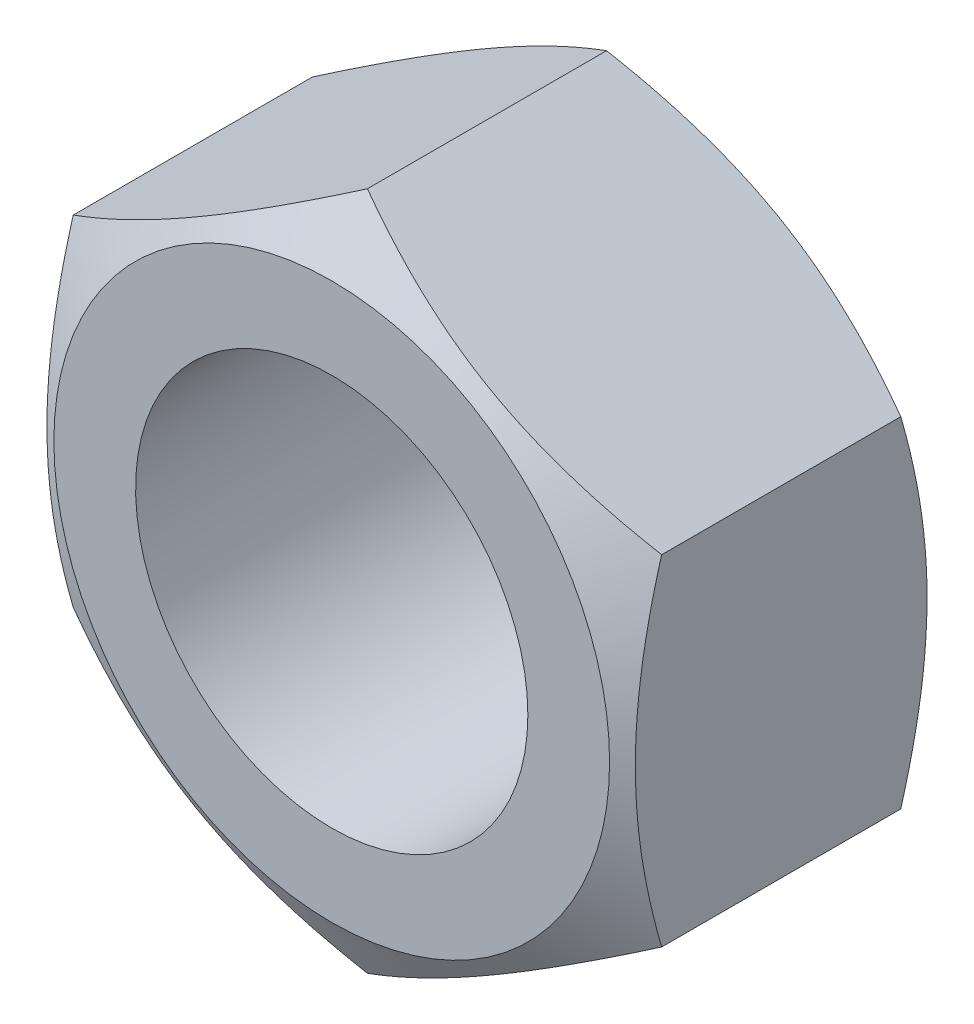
ISO-10303-21;
HEADER;
FILE_DESCRIPTION(('STEP AP214'),'2;1');
FILE_NAME('part.step','',(''),(''),'','','');
FILE_SCHEMA(('AUTOMOTIVE_DESIGN { 1 0 10303 214 1 1 1 1 }'));
ENDSEC;
DATA;
#1=APPLICATION_CONTEXT('core data for automotive mechanical design processes');
#2=APPLICATION_PROTOCOL_DEFINITION('international standard','automotive_design',2000,#1);
#3=PRODUCT_CONTEXT('',#1,'mechanical');
#4=PRODUCT('Part','Part','',(#3));
#5=PRODUCT_RELATED_PRODUCT_CATEGORY('part','',(#4));
#6=PRODUCT_DEFINITION_FORMATION('','',#4);
#7=PRODUCT_DEFINITION_CONTEXT('part definition',#1,'design');
#8=PRODUCT_DEFINITION('design','',#6,#7);
#9=PRODUCT_DEFINITION_SHAPE('','',#8);
#10=(LENGTH_UNIT() NAMED_UNIT(*) SI_UNIT(.MILLI.,.METRE.));
#11=(NAMED_UNIT(*) PLANE_ANGLE_UNIT() SI_UNIT($,.RADIAN.));
#12=(NAMED_UNIT(*) SI_UNIT($,.STERADIAN.) SOLID_ANGLE_UNIT());
#13=UNCERTAINTY_MEASURE_WITH_UNIT(LENGTH_MEASURE(1.E-05),#10,'distance_accuracy_value','');
#14=(GEOMETRIC_REPRESENTATION_CONTEXT(3) GLOBAL_UNCERTAINTY_ASSIGNED_CONTEXT((#13)) GLOBAL_UNIT_ASSIGNED_CONTEXT((#10,
#11,#12)) REPRESENTATION_CONTEXT('',''));
#15=CARTESIAN_POINT('',(0.,0.,0.));
#16=DIRECTION('',(0.,0.,1.));
#17=DIRECTION('',(1.,0.,0.));
#18=AXIS2_PLACEMENT_3D('',#15,#16,#17);
#19=CARTESIAN_POINT('',(-18.,-10.3923048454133,21.));
#20=DIRECTION('',(-1.,0.,0.));
#21=DIRECTION('',(0.,0.,1.));
#22=AXIS2_PLACEMENT_3D('',#19,#20,#21);
#23=PLANE('',#22);
#24=DIRECTION('',(0.,0.,-1.));
#25=VECTOR('',#24,1.);
#26=CARTESIAN_POINT('',(-18.,-10.3923048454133,21.));
#27=LINE('',#26,#25);
#28=CARTESIAN_POINT('',(-18.,-10.3923048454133,16.8149545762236));
#29=VERTEX_POINT('',#28);
#30=CARTESIAN_POINT('',(-18.,-10.3923048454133,2.18504542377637));
#31=VERTEX_POINT('',#30);
#32=EDGE_CURVE('E9',#29,#31,#27,.T.);
#33=ORIENTED_EDGE('',*,*,#32,.F.);
#34=CARTESIAN_POINT('',(-18.,-27.678158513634,9.75294647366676));
#35=CARTESIAN_POINT('',(-18.,-27.2860533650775,9.94272235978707));
#36=CARTESIAN_POINT('',(-18.,-26.8934816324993,10.1315337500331));
#37=CARTESIAN_POINT('',(-18.,-26.1073075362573,10.5070086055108));
#38=CARTESIAN_POINT('',(-18.,-25.7137051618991,10.693672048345));
#39=CARTESIAN_POINT('',(-18.,-24.5310977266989,11.2501628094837));
#40=CARTESIAN_POINT('',(-18.,-23.7404120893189,11.6164324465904));
#41=CARTESIAN_POINT('',(-18.,-22.1492517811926,12.3392469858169));
#42=CARTESIAN_POINT('',(-18.,-21.3487470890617,12.6957259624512));
#43=CARTESIAN_POINT('',(-18.,-19.7412878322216,13.3937806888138));
#44=CARTESIAN_POINT('',(-18.,-18.9343335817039,13.7353571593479));
#45=CARTESIAN_POINT('',(-18.,-17.2876078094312,14.4099305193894));
#46=CARTESIAN_POINT('',(-18.,-16.4475927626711,14.7423360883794));
#47=CARTESIAN_POINT('',(-18.,-14.7576419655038,15.3814120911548));
#48=CARTESIAN_POINT('',(-18.,-13.9077051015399,15.6880796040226));
#49=CARTESIAN_POINT('',(-18.,-12.1982556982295,16.2674507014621));
#50=CARTESIAN_POINT('',(-18.,-11.3387673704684,16.5402251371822));
#51=CARTESIAN_POINT('',(-18.,-9.60738310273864,17.042915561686));
#52=CARTESIAN_POINT('',(-18.,-8.73549124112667,17.2728453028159));
#53=CARTESIAN_POINT('',(-18.,-7.42060770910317,17.5765484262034));
#54=CARTESIAN_POINT('',(-18.,-6.98229810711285,17.6707239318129));
#55=CARTESIAN_POINT('',(-18.,-6.10272947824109,17.8441982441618));
#56=CARTESIAN_POINT('',(-18.,-5.66147051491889,17.9234973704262));
#57=CARTESIAN_POINT('',(-18.,-4.77633197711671,18.0658039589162));
#58=CARTESIAN_POINT('',(-18.,-4.33245247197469,18.1288118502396));
#59=CARTESIAN_POINT('',(-18.,-3.44253895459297,18.2372744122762));
#60=CARTESIAN_POINT('',(-18.,-2.99650494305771,18.2827290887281));
#61=CARTESIAN_POINT('',(-18.,-2.10864948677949,18.3546213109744));
#62=CARTESIAN_POINT('',(-18.,-1.66684728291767,18.3812950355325));
#63=CARTESIAN_POINT('',(-18.,-0.78251257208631,18.4159525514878));
#64=CARTESIAN_POINT('',(-18.,-0.339980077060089,18.4239366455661));
#65=CARTESIAN_POINT('',(-18.,0.545029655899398,18.4210256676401));
#66=CARTESIAN_POINT('',(-18.,0.987506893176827,18.4101303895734));
#67=CARTESIAN_POINT('',(-18.,1.8716145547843,18.3697222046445));
#68=CARTESIAN_POINT('',(-18.,2.31324493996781,18.3402084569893));
#69=CARTESIAN_POINT('',(-18.,3.38188442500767,18.2468825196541));
#70=CARTESIAN_POINT('',(-18.,4.0081005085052,18.1738337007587));
#71=CARTESIAN_POINT('',(-18.,5.2557313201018,17.9943375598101));
#72=CARTESIAN_POINT('',(-18.,5.87714535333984,17.8878854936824));
#73=CARTESIAN_POINT('',(-18.,7.11463218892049,17.6453701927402));
#74=CARTESIAN_POINT('',(-18.,7.73070028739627,17.509283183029));
#75=CARTESIAN_POINT('',(-18.,8.95658242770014,17.2116364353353));
#76=CARTESIAN_POINT('',(-18.,9.56639657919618,17.0500771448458));
#77=CARTESIAN_POINT('',(-18.,10.7930692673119,16.7016152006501));
#78=CARTESIAN_POINT('',(-18.,11.4097918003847,16.5142370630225));
#79=CARTESIAN_POINT('',(-18.,12.6371592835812,16.1206335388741));
#80=CARTESIAN_POINT('',(-18.,13.247804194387,15.9144080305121));
#81=CARTESIAN_POINT('',(-18.,14.4633274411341,15.4863391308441));
#82=CARTESIAN_POINT('',(-18.,15.068207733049,15.2645012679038));
#83=CARTESIAN_POINT('',(-18.,16.272990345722,14.8077670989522));
#84=CARTESIAN_POINT('',(-18.,16.8728927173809,14.5728709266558));
#85=CARTESIAN_POINT('',(-18.,18.2575646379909,14.0160878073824));
#86=CARTESIAN_POINT('',(-18.,19.0407253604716,13.6902065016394));
#87=CARTESIAN_POINT('',(-18.,20.6006658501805,13.0234723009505));
#88=CARTESIAN_POINT('',(-18.,21.3774452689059,12.6826185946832));
#89=CARTESIAN_POINT('',(-18.,22.9257732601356,11.988856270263));
#90=CARTESIAN_POINT('',(-18.,23.6973207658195,11.6359452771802));
#91=CARTESIAN_POINT('',(-18.,25.2358803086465,10.9204307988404));
#92=CARTESIAN_POINT('',(-18.,26.0028924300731,10.557827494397));
#93=CARTESIAN_POINT('',(-18.,27.5338791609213,9.82432596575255));
#94=CARTESIAN_POINT('',(-18.,28.2978499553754,9.4534197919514));
#95=CARTESIAN_POINT('',(-18.,29.8225723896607,8.70505034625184));
#96=CARTESIAN_POINT('',(-18.,30.58332401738,8.32758704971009));
#97=CARTESIAN_POINT('',(-18.,32.1020057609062,7.56724265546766));
#98=CARTESIAN_POINT('',(-18.,32.8599361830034,7.18436216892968));
#99=CARTESIAN_POINT('',(-18.,34.3734558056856,6.41400905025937));
#100=CARTESIAN_POINT('',(-18.,35.12904501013,6.02653642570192));
#101=CARTESIAN_POINT('',(-18.,37.2715446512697,4.92088640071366));
#102=CARTESIAN_POINT('',(-18.,38.6560721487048,4.1980913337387));
#103=CARTESIAN_POINT('',(-18.,41.4199837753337,2.74265154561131));
#104=CARTESIAN_POINT('',(-18.,42.7993677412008,2.01000651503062));
#105=CARTESIAN_POINT('',(-18.,45.5509144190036,0.538834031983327));
#106=CARTESIAN_POINT('',(-18.,46.9230864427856,-0.199676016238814));
#107=CARTESIAN_POINT('',(-18.,48.9789029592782,-1.31186595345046));
#108=CARTESIAN_POINT('',(-18.,49.6637511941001,-1.68332410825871));
#109=CARTESIAN_POINT('',(-18.,51.0327239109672,-2.42756928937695));
#110=CARTESIAN_POINT('',(-18.,51.7168483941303,-2.80035631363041));
#111=CARTESIAN_POINT('',(-18.,52.4006513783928,-3.17373230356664));
#112=B_SPLINE_CURVE_WITH_KNOTS('',3,(#34,#35,#36,#37,#38,#39,#40,#41,#42,#43,#44,#45,#46,#47,
#48,#49,#50,#51,#52,#53,#54,#55,#56,#57,#58,#59,#60,#61,#62,#63,#64,#65,#66,#67,#68,#69,#70,#71,
#72,#73,#74,#75,#76,#77,#78,#79,#80,#81,#82,#83,#84,#85,#86,#87,#88,#89,#90,#91,#92,#93,#94,#95,
#96,#97,#98,#99,#100,#101,#102,#103,#104,#105,#106,#107,#108,#109,#110,#111),.UNSPECIFIED.,.F.,
.F.,(4,2,2,2,2,2,2,2,2,2,2,2,2,2,2,2,2,2,2,2,2,2,2,2,2,2,2,2,2,2,2,2,2,2,2,2,2,2,4),(0.,
1.30684567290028,2.61370496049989,5.22782279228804,7.85657604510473,10.4852020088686,
13.1950587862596,15.9052226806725,18.6096222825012,21.3131523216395,22.657878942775,
24.0025766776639,25.347238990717,26.69190086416,28.0193354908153,29.3467486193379,
30.6741762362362,32.0016638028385,33.8919994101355,35.7826036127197,37.6747301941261,
39.5668235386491,41.5001415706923,43.4334721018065,45.3661214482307,47.2987510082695,
49.8433127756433,52.3880125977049,54.933216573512,57.4783731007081,60.0260805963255,
62.5737976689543,65.1212295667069,67.6686572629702,72.3541222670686,77.0397348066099,
81.7145709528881,84.0518726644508,86.3891707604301),.UNSPECIFIED.);
#113=CARTESIAN_POINT('',(-18.,10.3923048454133,16.8149545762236));
#114=VERTEX_POINT('',#113);
#115=EDGE_CURVE('E69',#29,#114,#112,.T.);
#116=ORIENTED_EDGE('',*,*,#115,.T.);
#117=DIRECTION('',(0.,0.,-1.));
#118=VECTOR('',#117,1.);
#119=CARTESIAN_POINT('',(-18.,10.3923048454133,21.));
#120=LINE('',#119,#118);
#121=CARTESIAN_POINT('',(-18.,10.3923048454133,2.18504542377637));
#122=VERTEX_POINT('',#121);
#123=EDGE_CURVE('E38',#114,#122,#120,.T.);
#124=ORIENTED_EDGE('',*,*,#123,.T.);
#125=CARTESIAN_POINT('',(-18.,-27.8861499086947,9.34783364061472));
#126=CARTESIAN_POINT('',(-18.,-27.4931891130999,9.15722210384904));
#127=CARTESIAN_POINT('',(-18.,-27.099766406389,8.96756328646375));
#128=CARTESIAN_POINT('',(-18.,-26.3119007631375,8.59036692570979));
#129=CARTESIAN_POINT('',(-18.,-25.9174578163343,8.40282940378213));
#130=CARTESIAN_POINT('',(-18.,-24.7323485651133,7.84367291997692));
#131=CARTESIAN_POINT('',(-18.,-23.940018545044,7.47556680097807));
#132=CARTESIAN_POINT('',(-18.,-22.3457208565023,6.74896572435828));
#133=CARTESIAN_POINT('',(-18.,-21.5437241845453,6.39053425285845));
#134=CARTESIAN_POINT('',(-18.,-19.9333425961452,5.6883727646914));
#135=CARTESIAN_POINT('',(-18.,-19.1249579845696,5.34464205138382));
#136=CARTESIAN_POINT('',(-18.,-17.4745599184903,4.66508646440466));
#137=CARTESIAN_POINT('',(-18.,-16.6322969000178,4.32986452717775));
#138=CARTESIAN_POINT('',(-18.,-14.9379003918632,3.68486026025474));
#139=CARTESIAN_POINT('',(-18.,-14.0857658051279,3.37508078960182));
#140=CARTESIAN_POINT('',(-18.,-12.3719025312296,2.78911928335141));
#141=CARTESIAN_POINT('',(-18.,-11.510197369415,2.51286899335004));
#142=CARTESIAN_POINT('',(-18.,-9.77434477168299,2.002833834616));
#143=CARTESIAN_POINT('',(-18.,-8.90020135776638,1.76903556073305));
#144=CARTESIAN_POINT('',(-18.,-7.58191550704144,1.45928805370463));
#145=CARTESIAN_POINT('',(-18.,-7.14250652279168,1.3630693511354));
#146=CARTESIAN_POINT('',(-18.,-6.26069150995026,1.18543230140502));
#147=CARTESIAN_POINT('',(-18.,-5.81828554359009,1.10401364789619));
#148=CARTESIAN_POINT('',(-18.,-4.93079197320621,0.957417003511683));
#149=CARTESIAN_POINT('',(-18.,-4.48570445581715,0.892238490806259));
#150=CARTESIAN_POINT('',(-18.,-3.59329678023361,0.779419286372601));
#151=CARTESIAN_POINT('',(-18.,-3.14597662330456,0.73177858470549));
#152=CARTESIAN_POINT('',(-18.,-2.25558265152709,0.655581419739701));
#153=CARTESIAN_POINT('',(-18.,-1.81252957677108,0.626784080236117));
#154=CARTESIAN_POINT('',(-18.,-0.925603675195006,0.587949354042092));
#155=CARTESIAN_POINT('',(-18.,-0.481730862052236,0.577911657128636));
#156=CARTESIAN_POINT('',(-18.,0.406043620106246,0.576834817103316));
#157=CARTESIAN_POINT('',(-18.,0.84994528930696,0.585795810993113));
#158=CARTESIAN_POINT('',(-18.,1.73697618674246,0.622498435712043));
#159=CARTESIAN_POINT('',(-18.,2.18010537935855,0.650240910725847));
#160=CARTESIAN_POINT('',(-18.,3.24592510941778,0.738967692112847));
#161=CARTESIAN_POINT('',(-18.,3.86788297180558,0.808909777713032));
#162=CARTESIAN_POINT('',(-18.,5.10716768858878,0.981977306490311));
#163=CARTESIAN_POINT('',(-18.,5.72449389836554,1.08510728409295));
#164=CARTESIAN_POINT('',(-18.,6.95393076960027,1.32088193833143));
#165=CARTESIAN_POINT('',(-18.,7.56603696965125,1.45354965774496));
#166=CARTESIAN_POINT('',(-18.,8.78410202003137,1.74435350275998));
#167=CARTESIAN_POINT('',(-18.,9.39006096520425,1.90248923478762));
#168=CARTESIAN_POINT('',(-18.,10.6092045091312,2.24413402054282));
#169=CARTESIAN_POINT('',(-18.,11.2222526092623,2.42812680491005));
#170=CARTESIAN_POINT('',(-18.,12.4423088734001,2.81505170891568));
#171=CARTESIAN_POINT('',(-18.,13.0493169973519,3.01798395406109));
#172=CARTESIAN_POINT('',(-18.,14.2575952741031,3.43957168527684));
#173=CARTESIAN_POINT('',(-18.,14.858867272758,3.65822190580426));
#174=CARTESIAN_POINT('',(-18.,16.0564328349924,4.10868007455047));
#175=CARTESIAN_POINT('',(-18.,16.652726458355,4.34048786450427));
#176=CARTESIAN_POINT('',(-18.,18.0662454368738,4.90508424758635));
#177=CARTESIAN_POINT('',(-18.,18.8814889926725,5.24282717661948));
#178=CARTESIAN_POINT('',(-18.,20.505009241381,5.93470997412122));
#179=CARTESIAN_POINT('',(-18.,21.3132854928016,6.28885087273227));
#180=CARTESIAN_POINT('',(-18.,22.924181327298,7.01022148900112));
#181=CARTESIAN_POINT('',(-18.,23.7267995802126,7.37745416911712));
#182=CARTESIAN_POINT('',(-18.,25.3271486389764,8.12234792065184));
#183=CARTESIAN_POINT('',(-18.,26.1248795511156,8.50000876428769));
#184=CARTESIAN_POINT('',(-18.,27.717152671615,9.26421902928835));
#185=CARTESIAN_POINT('',(-18.,28.5116903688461,9.65077783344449));
#186=CARTESIAN_POINT('',(-18.,30.0973432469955,10.430851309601));
#187=CARTESIAN_POINT('',(-18.,30.8884584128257,10.8243660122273));
#188=CARTESIAN_POINT('',(-18.,32.4676944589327,11.6171011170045));
#189=CARTESIAN_POINT('',(-18.,33.2558157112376,12.016320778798));
#190=CARTESIAN_POINT('',(-18.,34.8295964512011,12.819574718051));
#191=CARTESIAN_POINT('',(-18.,35.6152559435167,13.2236089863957));
#192=CARTESIAN_POINT('',(-18.,37.8363068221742,14.3730539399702));
#193=CARTESIAN_POINT('',(-18.,39.2692381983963,15.1232179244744));
#194=CARTESIAN_POINT('',(-18.,42.1298137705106,16.6336600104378));
#195=CARTESIAN_POINT('',(-18.,43.5574577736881,17.3939384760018));
#196=CARTESIAN_POINT('',(-18.,46.4050242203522,18.920315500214));
#197=CARTESIAN_POINT('',(-18.,47.8249570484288,19.6863946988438));
#198=CARTESIAN_POINT('',(-18.,49.9523662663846,20.8400066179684));
#199=CARTESIAN_POINT('',(-18.,50.6610684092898,21.2252822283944));
#200=CARTESIAN_POINT('',(-18.,52.0777370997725,21.9971810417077));
#201=CARTESIAN_POINT('',(-18.,52.7857036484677,22.3838042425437));
#202=CARTESIAN_POINT('',(-18.,53.4933442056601,22.7710233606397));
#203=B_SPLINE_CURVE_WITH_KNOTS('',3,(#125,#126,#127,#128,#129,#130,#131,#132,#133,#134,#135,
#136,#137,#138,#139,#140,#141,#142,#143,#144,#145,#146,#147,#148,#149,#150,#151,#152,#153,#154,
#155,#156,#157,#158,#159,#160,#161,#162,#163,#164,#165,#166,#167,#168,#169,#170,#171,#172,#173,
#174,#175,#176,#177,#178,#179,#180,#181,#182,#183,#184,#185,#186,#187,#188,#189,#190,#191,#192,
#193,#194,#195,#196,#197,#198,#199,#200,#201,#202),.UNSPECIFIED.,.F.,.F.,(4,2,2,2,2,2,2,2,2,2,2,
2,2,2,2,2,2,2,2,2,2,2,2,2,2,2,2,2,2,2,2,2,2,2,2,2,2,2,4),(0.,1.31024892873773,2.62051108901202,
5.2414246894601,7.8766552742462,10.5117608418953,13.2310107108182,15.9505657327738,
18.6644883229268,21.3775524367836,22.7268043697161,24.0760283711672,25.425209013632,
26.7743888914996,28.1059664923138,29.4375220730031,30.7690872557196,32.1007122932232,
33.9773078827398,35.854159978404,37.732481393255,39.6107737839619,41.5305984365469,
43.4504358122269,45.3696330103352,47.2888071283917,49.9358687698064,52.5830969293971,
55.2309279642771,57.8787012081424,60.5294074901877,63.180125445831,65.8305024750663,
68.480874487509,73.3330647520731,78.1854301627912,83.0256354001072,85.4456062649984,
87.8655734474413),.UNSPECIFIED.);
#204=EDGE_CURVE('E89',#31,#122,#203,.T.);
#205=ORIENTED_EDGE('',*,*,#204,.F.);
#206=EDGE_LOOP('',(#33,#116,#124,#205));
#207=FACE_BOUND('',#206,.T.);
#208=ADVANCED_FACE('F14',(#207),#23,.T.);
#209=CARTESIAN_POINT('',(-18.,-10.3923048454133,21.));
#210=DIRECTION('',(0.5,0.86602540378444,0.));
#211=DIRECTION('',(-0.86602540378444,0.5,0.));
#212=AXIS2_PLACEMENT_3D('',#209,#210,#211);
#213=PLANE('',#212);
#214=CARTESIAN_POINT('',(-18.0002,-10.3921893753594,16.8148879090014));
#215=CARTESIAN_POINT('',(-17.6045674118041,-10.6206079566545,16.9467563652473));
#216=CARTESIAN_POINT('',(-17.2073916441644,-10.8499174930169,17.0726408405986));
#217=CARTESIAN_POINT('',(-16.4098552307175,-11.310375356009,17.3107784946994));
#218=CARTESIAN_POINT('',(-16.0094935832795,-11.5415242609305,17.423027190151));
#219=CARTESIAN_POINT('',(-15.2048116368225,-12.0061075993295,17.6323844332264));
#220=CARTESIAN_POINT('',(-14.8004842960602,-12.2395460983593,17.7294571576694));
#221=CARTESIAN_POINT('',(-13.9890201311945,-12.7080451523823,17.9063779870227));
#222=CARTESIAN_POINT('',(-13.5818834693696,-12.9431056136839,17.9862270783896));
#223=CARTESIAN_POINT('',(-12.7752328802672,-13.4088255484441,18.1253044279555));
#224=CARTESIAN_POINT('',(-12.3757788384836,-13.6394504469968,18.1849930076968));
#225=CARTESIAN_POINT('',(-11.5750403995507,-14.1017570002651,18.2850773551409));
#226=CARTESIAN_POINT('',(-11.1737559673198,-14.3334386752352,18.3254727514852));
#227=CARTESIAN_POINT('',(-10.370513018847,-14.7971912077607,18.3859507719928));
#228=CARTESIAN_POINT('',(-9.96855587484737,-15.0292612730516,18.4060575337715));
#229=CARTESIAN_POINT('',(-9.16427056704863,-15.4936156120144,18.425525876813));
#230=CARTESIAN_POINT('',(-8.76194241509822,-15.7258998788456,18.4248880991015));
#231=CARTESIAN_POINT('',(-8.0097806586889,-16.1601606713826,18.404316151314));
#232=CARTESIAN_POINT('',(-7.65989346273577,-16.3621681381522,18.3868905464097));
#233=CARTESIAN_POINT('',(-6.96095368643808,-16.765701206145,18.3366806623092));
#234=CARTESIAN_POINT('',(-6.61190109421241,-16.9672268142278,18.3038966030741));
#235=CARTESIAN_POINT('',(-5.91476277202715,-17.3697198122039,18.2235386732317));
#236=CARTESIAN_POINT('',(-5.56667820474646,-17.5706865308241,18.1759514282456));
#237=CARTESIAN_POINT('',(-4.87216610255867,-17.9716632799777,18.0668268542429));
#238=CARTESIAN_POINT('',(-4.5257385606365,-18.1716733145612,18.0052895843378));
#239=CARTESIAN_POINT('',(-3.47411308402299,-18.7788295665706,17.7981876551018));
#240=CARTESIAN_POINT('',(-2.77196054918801,-19.1842175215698,17.6319722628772));
#241=CARTESIAN_POINT('',(-1.37812528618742,-19.9889486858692,17.2547315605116));
#242=CARTESIAN_POINT('',(-0.686424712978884,-20.3883021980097,17.0437948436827));
#243=CARTESIAN_POINT('',(0.00019999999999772,-20.7847251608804,16.8148879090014));
#244=B_SPLINE_CURVE_WITH_KNOTS('',3,(#214,#215,#216,#217,#218,#219,#220,#221,#222,#223,#224,
#225,#226,#227,#228,#229,#230,#231,#232,#233,#234,#235,#236,#237,#238,#239,#240,#241,#242,#243),
.UNSPECIFIED.,.F.,.F.,(4,2,2,2,2,2,2,2,2,2,2,2,2,2,4),(0.,1.42650335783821,2.85347447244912,
4.28376471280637,5.71397301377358,7.10888071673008,8.5038152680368,9.8970882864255,
11.2903182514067,12.5031974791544,13.7160593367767,14.9300201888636,16.1439758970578,
18.6253607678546,21.1018751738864),.UNSPECIFIED.);
#245=CARTESIAN_POINT('',(0.,-20.7846096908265,16.8149545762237));
#246=VERTEX_POINT('',#245);
#247=EDGE_CURVE('E77',#29,#246,#244,.T.);
#248=ORIENTED_EDGE('',*,*,#247,.F.);
#249=ORIENTED_EDGE('',*,*,#32,.T.);
#250=CARTESIAN_POINT('',(-18.0002,-10.3921893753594,2.18511209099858));
#251=CARTESIAN_POINT('',(-17.6045674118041,-10.6206079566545,2.05324363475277));
#252=CARTESIAN_POINT('',(-17.2073916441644,-10.8499174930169,1.92735915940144));
#253=CARTESIAN_POINT('',(-16.4098552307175,-11.310375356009,1.68922150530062));
#254=CARTESIAN_POINT('',(-16.0094935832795,-11.5415242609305,1.57697280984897));
#255=CARTESIAN_POINT('',(-15.2048116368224,-12.0061075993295,1.3676155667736));
#256=CARTESIAN_POINT('',(-14.8004842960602,-12.2395460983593,1.27054284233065));
#257=CARTESIAN_POINT('',(-13.9890201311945,-12.7080451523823,1.0936220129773));
#258=CARTESIAN_POINT('',(-13.5818834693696,-12.9431056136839,1.01377292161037));
#259=CARTESIAN_POINT('',(-12.7752328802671,-13.4088255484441,0.87469557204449));
#260=CARTESIAN_POINT('',(-12.3757788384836,-13.6394504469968,0.815006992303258));
#261=CARTESIAN_POINT('',(-11.5750403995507,-14.1017570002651,0.714922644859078));
#262=CARTESIAN_POINT('',(-11.1737559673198,-14.3334386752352,0.674527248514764));
#263=CARTESIAN_POINT('',(-10.370513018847,-14.7971912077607,0.614049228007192));
#264=CARTESIAN_POINT('',(-9.96855587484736,-15.0292612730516,0.593942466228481));
#265=CARTESIAN_POINT('',(-9.16427056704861,-15.4936156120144,0.574474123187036));
#266=CARTESIAN_POINT('',(-8.7619424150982,-15.7258998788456,0.575111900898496));
#267=CARTESIAN_POINT('',(-8.00978065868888,-16.1601606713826,0.595683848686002));
#268=CARTESIAN_POINT('',(-7.65989346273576,-16.3621681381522,0.613109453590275));
#269=CARTESIAN_POINT('',(-6.96095368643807,-16.765701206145,0.663319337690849));
#270=CARTESIAN_POINT('',(-6.6119010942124,-16.9672268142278,0.696103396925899));
#271=CARTESIAN_POINT('',(-5.91476277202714,-17.3697198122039,0.77646132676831));
#272=CARTESIAN_POINT('',(-5.56667820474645,-17.5706865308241,0.824048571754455));
#273=CARTESIAN_POINT('',(-4.87216610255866,-17.9716632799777,0.933173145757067));
#274=CARTESIAN_POINT('',(-4.5257385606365,-18.1716733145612,0.99471041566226));
#275=CARTESIAN_POINT('',(-3.47411308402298,-18.7788295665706,1.20181234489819));
#276=CARTESIAN_POINT('',(-2.77196054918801,-19.1842175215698,1.36802773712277));
#277=CARTESIAN_POINT('',(-1.37812528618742,-19.9889486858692,1.74526843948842));
#278=CARTESIAN_POINT('',(-0.686424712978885,-20.3883021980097,1.95620515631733));
#279=CARTESIAN_POINT('',(0.000199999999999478,-20.7847251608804,2.18511209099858));
#280=B_SPLINE_CURVE_WITH_KNOTS('',3,(#250,#251,#252,#253,#254,#255,#256,#257,#258,#259,#260,
#261,#262,#263,#264,#265,#266,#267,#268,#269,#270,#271,#272,#273,#274,#275,#276,#277,#278,#279),
.UNSPECIFIED.,.F.,.F.,(4,2,2,2,2,2,2,2,2,2,2,2,2,2,4),(0.,1.42650335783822,2.85347447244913,
4.28376471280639,5.7139730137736,7.10888071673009,8.50381526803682,9.89708828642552,
11.2903182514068,12.5031974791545,13.7160593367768,14.9300201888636,16.1439758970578,
18.6253607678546,21.1018751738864),.UNSPECIFIED.);
#281=CARTESIAN_POINT('',(0.,-20.7846096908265,2.18504542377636));
#282=VERTEX_POINT('',#281);
#283=EDGE_CURVE('E111',#31,#282,#280,.T.);
#284=ORIENTED_EDGE('',*,*,#283,.T.);
#285=DIRECTION('',(0.,0.,-1.));
#286=VECTOR('',#285,1.);
#287=CARTESIAN_POINT('',(0.,-20.7846096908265,21.));
#288=LINE('',#287,#286);
#289=EDGE_CURVE('E23',#246,#282,#288,.T.);
#290=ORIENTED_EDGE('',*,*,#289,.F.);
#291=EDGE_LOOP('',(#248,#249,#284,#290));
#292=FACE_BOUND('',#291,.T.);
#293=ADVANCED_FACE('F16',(#292),#213,.F.);
#294=CARTESIAN_POINT('',(18.,-10.3923048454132,21.));
#295=DIRECTION('',(0.5,-0.866025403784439,0.));
#296=DIRECTION('',(0.86602540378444,0.5,0.));
#297=AXIS2_PLACEMENT_3D('',#294,#295,#296);
#298=PLANE('',#297);
#299=DIRECTION('',(0.,0.,-1.));
#300=VECTOR('',#299,1.);
#301=CARTESIAN_POINT('',(18.,-10.3923048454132,21.));
#302=LINE('',#301,#300);
#303=CARTESIAN_POINT('',(18.,-10.3923048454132,16.8149545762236));
#304=VERTEX_POINT('',#303);
#305=CARTESIAN_POINT('',(18.,-10.3923048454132,2.18504542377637));
#306=VERTEX_POINT('',#305);
#307=EDGE_CURVE('E94',#304,#306,#302,.T.);
#308=ORIENTED_EDGE('',*,*,#307,.F.);
#309=CARTESIAN_POINT('',(18.0002,-10.3921893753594,16.8148879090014));
#310=CARTESIAN_POINT('',(17.6045674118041,-10.6206079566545,16.9467563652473));
#311=CARTESIAN_POINT('',(17.2073916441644,-10.8499174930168,17.0726408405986));
#312=CARTESIAN_POINT('',(16.4098552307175,-11.3103753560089,17.3107784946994));
#313=CARTESIAN_POINT('',(16.0094935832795,-11.5415242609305,17.4230271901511));
#314=CARTESIAN_POINT('',(15.2048116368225,-12.0061075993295,17.6323844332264));
#315=CARTESIAN_POINT('',(14.8004842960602,-12.2395460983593,17.7294571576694));
#316=CARTESIAN_POINT('',(13.9890201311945,-12.7080451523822,17.9063779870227));
#317=CARTESIAN_POINT('',(13.5818834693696,-12.9431056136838,17.9862270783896));
#318=CARTESIAN_POINT('',(12.7752328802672,-13.4088255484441,18.1253044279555));
#319=CARTESIAN_POINT('',(12.3757788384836,-13.6394504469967,18.1849930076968));
#320=CARTESIAN_POINT('',(11.5750403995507,-14.1017570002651,18.2850773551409));
#321=CARTESIAN_POINT('',(11.1737559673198,-14.3334386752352,18.3254727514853));
#322=CARTESIAN_POINT('',(10.3705130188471,-14.7971912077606,18.3859507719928));
#323=CARTESIAN_POINT('',(9.96855587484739,-15.0292612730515,18.4060575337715));
#324=CARTESIAN_POINT('',(9.16427056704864,-15.4936156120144,18.425525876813));
#325=CARTESIAN_POINT('',(8.76194241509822,-15.7258998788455,18.4248880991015));
#326=CARTESIAN_POINT('',(8.0097806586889,-16.1601606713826,18.404316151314));
#327=CARTESIAN_POINT('',(7.65989346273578,-16.3621681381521,18.3868905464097));
#328=CARTESIAN_POINT('',(6.96095368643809,-16.765701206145,18.3366806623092));
#329=CARTESIAN_POINT('',(6.61190109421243,-16.9672268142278,18.3038966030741));
#330=CARTESIAN_POINT('',(5.91476277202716,-17.3697198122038,18.2235386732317));
#331=CARTESIAN_POINT('',(5.56667820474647,-17.5706865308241,18.1759514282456));
#332=CARTESIAN_POINT('',(4.87216610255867,-17.9716632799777,18.066826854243));
#333=CARTESIAN_POINT('',(4.52573856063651,-18.1716733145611,18.0052895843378));
#334=CARTESIAN_POINT('',(3.47411308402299,-18.7788295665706,17.7981876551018));
#335=CARTESIAN_POINT('',(2.77196054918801,-19.1842175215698,17.6319722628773));
#336=CARTESIAN_POINT('',(1.37812528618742,-19.9889486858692,17.2547315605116));
#337=CARTESIAN_POINT('',(0.686424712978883,-20.3883021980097,17.0437948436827));
#338=CARTESIAN_POINT('',(-0.000199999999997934,-20.7847251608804,16.8148879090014));
#339=B_SPLINE_CURVE_WITH_KNOTS('',3,(#309,#310,#311,#312,#313,#314,#315,#316,#317,#318,#319,
#320,#321,#322,#323,#324,#325,#326,#327,#328,#329,#330,#331,#332,#333,#334,#335,#336,#337,#338),
.UNSPECIFIED.,.F.,.F.,(4,2,2,2,2,2,2,2,2,2,2,2,2,2,4),(0.,1.42650335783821,2.85347447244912,
4.28376471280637,5.71397301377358,7.10888071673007,8.5038152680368,9.89708828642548,
11.2903182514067,12.5031974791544,13.7160593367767,14.9300201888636,16.1439758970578,
18.6253607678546,21.1018751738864),.UNSPECIFIED.);
#340=EDGE_CURVE('E103',#304,#246,#339,.T.);
#341=ORIENTED_EDGE('',*,*,#340,.T.);
#342=ORIENTED_EDGE('',*,*,#289,.T.);
#343=CARTESIAN_POINT('',(18.0002,-10.3921893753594,2.18511209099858));
#344=CARTESIAN_POINT('',(17.6045674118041,-10.6206079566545,2.05324363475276));
#345=CARTESIAN_POINT('',(17.2073916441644,-10.8499174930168,1.92735915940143));
#346=CARTESIAN_POINT('',(16.4098552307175,-11.3103753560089,1.68922150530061));
#347=CARTESIAN_POINT('',(16.0094935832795,-11.5415242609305,1.57697280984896));
#348=CARTESIAN_POINT('',(15.2048116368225,-12.0061075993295,1.3676155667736));
#349=CARTESIAN_POINT('',(14.8004842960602,-12.2395460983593,1.27054284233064));
#350=CARTESIAN_POINT('',(13.9890201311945,-12.7080451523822,1.09362201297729));
#351=CARTESIAN_POINT('',(13.5818834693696,-12.9431056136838,1.01377292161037));
#352=CARTESIAN_POINT('',(12.7752328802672,-13.4088255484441,0.874695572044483));
#353=CARTESIAN_POINT('',(12.3757788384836,-13.6394504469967,0.81500699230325));
#354=CARTESIAN_POINT('',(11.5750403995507,-14.1017570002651,0.714922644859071));
#355=CARTESIAN_POINT('',(11.1737559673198,-14.3334386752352,0.674527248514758));
#356=CARTESIAN_POINT('',(10.370513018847,-14.7971912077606,0.614049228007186));
#357=CARTESIAN_POINT('',(9.96855587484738,-15.0292612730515,0.593942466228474));
#358=CARTESIAN_POINT('',(9.16427056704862,-15.4936156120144,0.574474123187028));
#359=CARTESIAN_POINT('',(8.7619424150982,-15.7258998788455,0.57511190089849));
#360=CARTESIAN_POINT('',(8.00978065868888,-16.1601606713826,0.595683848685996));
#361=CARTESIAN_POINT('',(7.65989346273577,-16.3621681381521,0.613109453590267));
#362=CARTESIAN_POINT('',(6.96095368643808,-16.765701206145,0.663319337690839));
#363=CARTESIAN_POINT('',(6.61190109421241,-16.9672268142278,0.696103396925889));
#364=CARTESIAN_POINT('',(5.91476277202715,-17.3697198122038,0.776461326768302));
#365=CARTESIAN_POINT('',(5.56667820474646,-17.5706865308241,0.824048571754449));
#366=CARTESIAN_POINT('',(4.87216610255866,-17.9716632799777,0.933173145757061));
#367=CARTESIAN_POINT('',(4.5257385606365,-18.1716733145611,0.994710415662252));
#368=CARTESIAN_POINT('',(3.47411308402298,-18.7788295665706,1.20181234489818));
#369=CARTESIAN_POINT('',(2.77196054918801,-19.1842175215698,1.36802773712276));
#370=CARTESIAN_POINT('',(1.37812528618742,-19.9889486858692,1.74526843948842));
#371=CARTESIAN_POINT('',(0.686424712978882,-20.3883021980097,1.95620515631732));
#372=CARTESIAN_POINT('',(-0.000200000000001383,-20.7847251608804,2.18511209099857));
#373=B_SPLINE_CURVE_WITH_KNOTS('',3,(#343,#344,#345,#346,#347,#348,#349,#350,#351,#352,#353,
#354,#355,#356,#357,#358,#359,#360,#361,#362,#363,#364,#365,#366,#367,#368,#369,#370,#371,#372),
.UNSPECIFIED.,.F.,.F.,(4,2,2,2,2,2,2,2,2,2,2,2,2,2,4),(0.,1.42650335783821,2.85347447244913,
4.28376471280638,5.71397301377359,7.10888071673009,8.50381526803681,9.8970882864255,
11.2903182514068,12.5031974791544,13.7160593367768,14.9300201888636,16.1439758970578,
18.6253607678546,21.1018751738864),.UNSPECIFIED.);
#374=EDGE_CURVE('E102',#306,#282,#373,.T.);
#375=ORIENTED_EDGE('',*,*,#374,.F.);
#376=EDGE_LOOP('',(#308,#341,#342,#375));
#377=FACE_BOUND('',#376,.T.);
#378=ADVANCED_FACE('F101',(#377),#298,.T.);
#379=CARTESIAN_POINT('',(18.,-10.3923048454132,21.));
#380=DIRECTION('',(-1.,0.,0.));
#381=DIRECTION('',(0.,0.,1.));
#382=AXIS2_PLACEMENT_3D('',#379,#380,#381);
#383=PLANE('',#382);
#384=CARTESIAN_POINT('',(18.,-27.6781585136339,9.75294647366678));
#385=CARTESIAN_POINT('',(18.,-27.2860533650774,9.94272235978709));
#386=CARTESIAN_POINT('',(18.,-26.8934816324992,10.1315337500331));
#387=CARTESIAN_POINT('',(18.,-26.1073075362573,10.5070086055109));
#388=CARTESIAN_POINT('',(18.,-25.7137051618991,10.6936720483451));
#389=CARTESIAN_POINT('',(18.,-24.5310977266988,11.2501628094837));
#390=CARTESIAN_POINT('',(18.,-23.7404120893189,11.6164324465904));
#391=CARTESIAN_POINT('',(18.,-22.1492517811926,12.3392469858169));
#392=CARTESIAN_POINT('',(18.,-21.3487470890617,12.6957259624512));
#393=CARTESIAN_POINT('',(18.,-19.7412878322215,13.3937806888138));
#394=CARTESIAN_POINT('',(18.,-18.9343335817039,13.735357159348));
#395=CARTESIAN_POINT('',(18.,-17.2876078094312,14.4099305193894));
#396=CARTESIAN_POINT('',(18.,-16.4475927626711,14.7423360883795));
#397=CARTESIAN_POINT('',(18.,-14.7576419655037,15.3814120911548));
#398=CARTESIAN_POINT('',(18.,-13.9077051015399,15.6880796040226));
#399=CARTESIAN_POINT('',(18.,-12.1982556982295,16.2674507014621));
#400=CARTESIAN_POINT('',(18.,-11.3387673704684,16.5402251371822));
#401=CARTESIAN_POINT('',(18.,-9.60738310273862,17.042915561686));
#402=CARTESIAN_POINT('',(18.,-8.73549124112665,17.2728453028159));
#403=CARTESIAN_POINT('',(18.,-7.42060770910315,17.5765484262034));
#404=CARTESIAN_POINT('',(18.,-6.98229810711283,17.6707239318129));
#405=CARTESIAN_POINT('',(18.,-6.10272947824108,17.8441982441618));
#406=CARTESIAN_POINT('',(18.,-5.66147051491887,17.9234973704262));
#407=CARTESIAN_POINT('',(18.,-4.7763319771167,18.0658039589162));
#408=CARTESIAN_POINT('',(18.,-4.33245247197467,18.1288118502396));
#409=CARTESIAN_POINT('',(18.,-3.44253895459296,18.2372744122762));
#410=CARTESIAN_POINT('',(18.,-2.99650494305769,18.2827290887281));
#411=CARTESIAN_POINT('',(18.,-2.10864948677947,18.3546213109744));
#412=CARTESIAN_POINT('',(18.,-1.66684728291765,18.3812950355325));
#413=CARTESIAN_POINT('',(18.,-0.782512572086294,18.4159525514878));
#414=CARTESIAN_POINT('',(18.,-0.339980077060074,18.4239366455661));
#415=CARTESIAN_POINT('',(18.,0.545029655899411,18.4210256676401));
#416=CARTESIAN_POINT('',(18.,0.987506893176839,18.4101303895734));
#417=CARTESIAN_POINT('',(18.,1.87161455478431,18.3697222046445));
#418=CARTESIAN_POINT('',(18.,2.31324493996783,18.3402084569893));
#419=CARTESIAN_POINT('',(18.,3.38188442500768,18.2468825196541));
#420=CARTESIAN_POINT('',(18.,4.0081005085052,18.1738337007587));
#421=CARTESIAN_POINT('',(18.,5.25573132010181,17.99433755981));
#422=CARTESIAN_POINT('',(18.,5.87714535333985,17.8878854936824));
#423=CARTESIAN_POINT('',(18.,7.1146321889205,17.6453701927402));
#424=CARTESIAN_POINT('',(18.,7.73070028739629,17.509283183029));
#425=CARTESIAN_POINT('',(18.,8.95658242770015,17.2116364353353));
#426=CARTESIAN_POINT('',(18.,9.56639657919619,17.0500771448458));
#427=CARTESIAN_POINT('',(18.,10.7930692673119,16.7016152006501));
#428=CARTESIAN_POINT('',(18.,11.4097918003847,16.5142370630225));
#429=CARTESIAN_POINT('',(18.,12.6371592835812,16.1206335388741));
#430=CARTESIAN_POINT('',(18.,13.247804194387,15.9144080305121));
#431=CARTESIAN_POINT('',(18.,14.4633274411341,15.4863391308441));
#432=CARTESIAN_POINT('',(18.,15.068207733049,15.2645012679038));
#433=CARTESIAN_POINT('',(18.,16.272990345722,14.8077670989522));
#434=CARTESIAN_POINT('',(18.,16.8728927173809,14.5728709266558));
#435=CARTESIAN_POINT('',(18.,18.2575646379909,14.0160878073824));
#436=CARTESIAN_POINT('',(18.,19.0407253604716,13.6902065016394));
#437=CARTESIAN_POINT('',(18.,20.6006658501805,13.0234723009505));
#438=CARTESIAN_POINT('',(18.,21.3774452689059,12.6826185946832));
#439=CARTESIAN_POINT('',(18.,22.9257732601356,11.988856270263));
#440=CARTESIAN_POINT('',(18.,23.6973207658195,11.6359452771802));
#441=CARTESIAN_POINT('',(18.,25.2358803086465,10.9204307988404));
#442=CARTESIAN_POINT('',(18.,26.0028924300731,10.557827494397));
#443=CARTESIAN_POINT('',(18.,27.5338791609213,9.82432596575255));
#444=CARTESIAN_POINT('',(18.,28.2978499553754,9.45341979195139));
#445=CARTESIAN_POINT('',(18.,29.8225723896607,8.70505034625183));
#446=CARTESIAN_POINT('',(18.,30.58332401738,8.32758704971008));
#447=CARTESIAN_POINT('',(18.,32.1020057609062,7.56724265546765));
#448=CARTESIAN_POINT('',(18.,32.8599361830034,7.18436216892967));
#449=CARTESIAN_POINT('',(18.,34.3734558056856,6.41400905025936));
#450=CARTESIAN_POINT('',(18.,35.12904501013,6.02653642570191));
#451=CARTESIAN_POINT('',(18.,37.2715446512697,4.92088640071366));
#452=CARTESIAN_POINT('',(18.,38.6560721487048,4.1980913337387));
#453=CARTESIAN_POINT('',(18.,41.4199837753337,2.74265154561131));
#454=CARTESIAN_POINT('',(18.,42.7993677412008,2.01000651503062));
#455=CARTESIAN_POINT('',(18.,45.5509144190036,0.538834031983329));
#456=CARTESIAN_POINT('',(18.,46.9230864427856,-0.199676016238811));
#457=CARTESIAN_POINT('',(18.,48.9789029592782,-1.31186595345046));
#458=CARTESIAN_POINT('',(18.,49.6637511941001,-1.68332410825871));
#459=CARTESIAN_POINT('',(18.,51.0327239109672,-2.42756928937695));
#460=CARTESIAN_POINT('',(18.,51.7168483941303,-2.80035631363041));
#461=CARTESIAN_POINT('',(18.,52.4006513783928,-3.17373230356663));
#462=B_SPLINE_CURVE_WITH_KNOTS('',3,(#384,#385,#386,#387,#388,#389,#390,#391,#392,#393,#394,
#395,#396,#397,#398,#399,#400,#401,#402,#403,#404,#405,#406,#407,#408,#409,#410,#411,#412,#413,
#414,#415,#416,#417,#418,#419,#420,#421,#422,#423,#424,#425,#426,#427,#428,#429,#430,#431,#432,
#433,#434,#435,#436,#437,#438,#439,#440,#441,#442,#443,#444,#445,#446,#447,#448,#449,#450,#451,
#452,#453,#454,#455,#456,#457,#458,#459,#460,#461),.UNSPECIFIED.,.F.,.F.,(4,2,2,2,2,2,2,2,2,2,2,
2,2,2,2,2,2,2,2,2,2,2,2,2,2,2,2,2,2,2,2,2,2,2,2,2,2,2,4),(0.,1.30684567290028,2.61370496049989,
5.22782279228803,7.85657604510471,10.4852020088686,13.1950587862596,15.9052226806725,
18.6096222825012,21.3131523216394,22.657878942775,24.0025766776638,25.3472389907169,
26.6919008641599,28.0193354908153,29.3467486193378,30.6741762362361,32.0016638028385,
33.8919994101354,35.7826036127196,37.674730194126,39.566823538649,41.5001415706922,
43.4334721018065,45.3661214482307,47.2987510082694,49.8433127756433,52.3880125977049,
54.933216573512,57.4783731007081,60.0260805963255,62.5737976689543,65.1212295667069,
67.6686572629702,72.3541222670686,77.0397348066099,81.7145709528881,84.0518726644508,
86.38917076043),.UNSPECIFIED.);
#463=CARTESIAN_POINT('',(18.,10.3923048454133,16.8149545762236));
#464=VERTEX_POINT('',#463);
#465=EDGE_CURVE('E173',#304,#464,#462,.T.);
#466=ORIENTED_EDGE('',*,*,#465,.F.);
#467=ORIENTED_EDGE('',*,*,#307,.T.);
#468=CARTESIAN_POINT('',(18.,-27.8861499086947,9.34783364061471));
#469=CARTESIAN_POINT('',(18.,-27.4931891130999,9.15722210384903));
#470=CARTESIAN_POINT('',(18.,-27.099766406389,8.96756328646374));
#471=CARTESIAN_POINT('',(18.,-26.3119007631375,8.59036692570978));
#472=CARTESIAN_POINT('',(18.,-25.9174578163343,8.40282940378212));
#473=CARTESIAN_POINT('',(18.,-24.7323485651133,7.84367291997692));
#474=CARTESIAN_POINT('',(18.,-23.940018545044,7.47556680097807));
#475=CARTESIAN_POINT('',(18.,-22.3457208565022,6.74896572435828));
#476=CARTESIAN_POINT('',(18.,-21.5437241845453,6.39053425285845));
#477=CARTESIAN_POINT('',(18.,-19.9333425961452,5.68837276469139));
#478=CARTESIAN_POINT('',(18.,-19.1249579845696,5.34464205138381));
#479=CARTESIAN_POINT('',(18.,-17.4745599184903,4.66508646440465));
#480=CARTESIAN_POINT('',(18.,-16.6322969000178,4.32986452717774));
#481=CARTESIAN_POINT('',(18.,-14.9379003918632,3.68486026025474));
#482=CARTESIAN_POINT('',(18.,-14.0857658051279,3.37508078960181));
#483=CARTESIAN_POINT('',(18.,-12.3719025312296,2.7891192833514));
#484=CARTESIAN_POINT('',(18.,-11.510197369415,2.51286899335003));
#485=CARTESIAN_POINT('',(18.,-9.77434477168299,2.002833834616));
#486=CARTESIAN_POINT('',(18.,-8.90020135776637,1.76903556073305));
#487=CARTESIAN_POINT('',(18.,-7.58191550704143,1.45928805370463));
#488=CARTESIAN_POINT('',(18.,-7.14250652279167,1.36306935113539));
#489=CARTESIAN_POINT('',(18.,-6.26069150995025,1.18543230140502));
#490=CARTESIAN_POINT('',(18.,-5.81828554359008,1.10401364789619));
#491=CARTESIAN_POINT('',(18.,-4.9307919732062,0.957417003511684));
#492=CARTESIAN_POINT('',(18.,-4.48570445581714,0.892238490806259));
#493=CARTESIAN_POINT('',(18.,-3.59329678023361,0.7794192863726));
#494=CARTESIAN_POINT('',(18.,-3.14597662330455,0.731778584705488));
#495=CARTESIAN_POINT('',(18.,-2.25558265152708,0.655581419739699));
#496=CARTESIAN_POINT('',(18.,-1.81252957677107,0.626784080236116));
#497=CARTESIAN_POINT('',(18.,-0.925603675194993,0.587949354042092));
#498=CARTESIAN_POINT('',(18.,-0.481730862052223,0.577911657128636));
#499=CARTESIAN_POINT('',(18.,0.40604362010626,0.576834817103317));
#500=CARTESIAN_POINT('',(18.,0.849945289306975,0.585795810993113));
#501=CARTESIAN_POINT('',(18.,1.73697618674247,0.622498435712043));
#502=CARTESIAN_POINT('',(18.,2.18010537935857,0.650240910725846));
#503=CARTESIAN_POINT('',(18.,3.2459251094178,0.738967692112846));
#504=CARTESIAN_POINT('',(18.,3.86788297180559,0.808909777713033));
#505=CARTESIAN_POINT('',(18.,5.10716768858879,0.981977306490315));
#506=CARTESIAN_POINT('',(18.,5.72449389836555,1.08510728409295));
#507=CARTESIAN_POINT('',(18.,6.95393076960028,1.32088193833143));
#508=CARTESIAN_POINT('',(18.,7.56603696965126,1.45354965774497));
#509=CARTESIAN_POINT('',(18.,8.78410202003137,1.74435350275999));
#510=CARTESIAN_POINT('',(18.,9.39006096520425,1.90248923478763));
#511=CARTESIAN_POINT('',(18.,10.6092045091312,2.24413402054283));
#512=CARTESIAN_POINT('',(18.,11.2222526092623,2.42812680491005));
#513=CARTESIAN_POINT('',(18.,12.4423088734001,2.81505170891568));
#514=CARTESIAN_POINT('',(18.,13.0493169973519,3.01798395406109));
#515=CARTESIAN_POINT('',(18.,14.2575952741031,3.43957168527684));
#516=CARTESIAN_POINT('',(18.,14.858867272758,3.65822190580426));
#517=CARTESIAN_POINT('',(18.,16.0564328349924,4.10868007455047));
#518=CARTESIAN_POINT('',(18.,16.652726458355,4.34048786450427));
#519=CARTESIAN_POINT('',(18.,18.0662454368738,4.90508424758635));
#520=CARTESIAN_POINT('',(18.,18.8814889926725,5.24282717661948));
#521=CARTESIAN_POINT('',(18.,20.505009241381,5.93470997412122));
#522=CARTESIAN_POINT('',(18.,21.3132854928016,6.28885087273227));
#523=CARTESIAN_POINT('',(18.,22.924181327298,7.01022148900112));
#524=CARTESIAN_POINT('',(18.,23.7267995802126,7.37745416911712));
#525=CARTESIAN_POINT('',(18.,25.3271486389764,8.12234792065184));
#526=CARTESIAN_POINT('',(18.,26.1248795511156,8.50000876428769));
#527=CARTESIAN_POINT('',(18.,27.717152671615,9.26421902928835));
#528=CARTESIAN_POINT('',(18.,28.5116903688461,9.65077783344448));
#529=CARTESIAN_POINT('',(18.,30.0973432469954,10.430851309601));
#530=CARTESIAN_POINT('',(18.,30.8884584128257,10.8243660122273));
#531=CARTESIAN_POINT('',(18.,32.4676944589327,11.6171011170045));
#532=CARTESIAN_POINT('',(18.,33.2558157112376,12.016320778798));
#533=CARTESIAN_POINT('',(18.,34.8295964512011,12.819574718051));
#534=CARTESIAN_POINT('',(18.,35.6152559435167,13.2236089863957));
#535=CARTESIAN_POINT('',(18.,37.8363068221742,14.3730539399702));
#536=CARTESIAN_POINT('',(18.,39.2692381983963,15.1232179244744));
#537=CARTESIAN_POINT('',(18.,42.1298137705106,16.6336600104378));
#538=CARTESIAN_POINT('',(18.,43.557457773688,17.3939384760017));
#539=CARTESIAN_POINT('',(18.,46.4050242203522,18.920315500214));
#540=CARTESIAN_POINT('',(18.,47.8249570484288,19.6863946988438));
#541=CARTESIAN_POINT('',(18.,49.9523662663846,20.8400066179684));
#542=CARTESIAN_POINT('',(18.,50.6610684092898,21.2252822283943));
#543=CARTESIAN_POINT('',(18.,52.0777370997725,21.9971810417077));
#544=CARTESIAN_POINT('',(18.,52.7857036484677,22.3838042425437));
#545=CARTESIAN_POINT('',(18.,53.4933442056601,22.7710233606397));
#546=B_SPLINE_CURVE_WITH_KNOTS('',3,(#468,#469,#470,#471,#472,#473,#474,#475,#476,#477,#478,
#479,#480,#481,#482,#483,#484,#485,#486,#487,#488,#489,#490,#491,#492,#493,#494,#495,#496,#497,
#498,#499,#500,#501,#502,#503,#504,#505,#506,#507,#508,#509,#510,#511,#512,#513,#514,#515,#516,
#517,#518,#519,#520,#521,#522,#523,#524,#525,#526,#527,#528,#529,#530,#531,#532,#533,#534,#535,
#536,#537,#538,#539,#540,#541,#542,#543,#544,#545),.UNSPECIFIED.,.F.,.F.,(4,2,2,2,2,2,2,2,2,2,2,
2,2,2,2,2,2,2,2,2,2,2,2,2,2,2,2,2,2,2,2,2,2,2,2,2,2,2,4),(0.,1.31024892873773,2.62051108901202,
5.24142468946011,7.8766552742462,10.5117608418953,13.2310107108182,15.9505657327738,
18.6644883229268,21.3775524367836,22.7268043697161,24.0760283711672,25.425209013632,
26.7743888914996,28.1059664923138,29.4375220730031,30.7690872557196,32.1007122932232,
33.9773078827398,35.854159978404,37.732481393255,39.6107737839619,41.5305984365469,
43.4504358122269,45.3696330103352,47.2888071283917,49.9358687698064,52.5830969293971,
55.2309279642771,57.8787012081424,60.5294074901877,63.180125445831,65.8305024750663,
68.480874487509,73.3330647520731,78.1854301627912,83.0256354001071,85.4456062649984,
87.8655734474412),.UNSPECIFIED.);
#547=CARTESIAN_POINT('',(18.,10.3923048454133,2.18504542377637));
#548=VERTEX_POINT('',#547);
#549=EDGE_CURVE('E114',#306,#548,#546,.T.);
#550=ORIENTED_EDGE('',*,*,#549,.T.);
#551=DIRECTION('',(0.,0.,-1.));
#552=VECTOR('',#551,1.);
#553=CARTESIAN_POINT('',(18.,10.3923048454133,21.));
#554=LINE('',#553,#552);
#555=EDGE_CURVE('E86',#464,#548,#554,.T.);
#556=ORIENTED_EDGE('',*,*,#555,.F.);
#557=EDGE_LOOP('',(#466,#467,#550,#556));
#558=FACE_BOUND('',#557,.T.);
#559=ADVANCED_FACE('F164',(#558),#383,.F.);
#560=CARTESIAN_POINT('',(18.,10.3923048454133,21.));
#561=DIRECTION('',(-0.5,-0.86602540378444,0.));
#562=DIRECTION('',(0.86602540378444,-0.5,0.));
#563=AXIS2_PLACEMENT_3D('',#560,#561,#562);
#564=PLANE('',#563);
#565=CARTESIAN_POINT('',(18.0002,10.3921893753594,16.8148879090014));
#566=CARTESIAN_POINT('',(17.6045674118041,10.6206079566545,16.9467563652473));
#567=CARTESIAN_POINT('',(17.2073916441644,10.8499174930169,17.0726408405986));
#568=CARTESIAN_POINT('',(16.4098552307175,11.310375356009,17.3107784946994));
#569=CARTESIAN_POINT('',(16.0094935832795,11.5415242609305,17.423027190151));
#570=CARTESIAN_POINT('',(15.2048116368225,12.0061075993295,17.6323844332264));
#571=CARTESIAN_POINT('',(14.8004842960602,12.2395460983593,17.7294571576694));
#572=CARTESIAN_POINT('',(13.9890201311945,12.7080451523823,17.9063779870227));
#573=CARTESIAN_POINT('',(13.5818834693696,12.9431056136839,17.9862270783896));
#574=CARTESIAN_POINT('',(12.7752328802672,13.4088255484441,18.1253044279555));
#575=CARTESIAN_POINT('',(12.3757788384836,13.6394504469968,18.1849930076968));
#576=CARTESIAN_POINT('',(11.5750403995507,14.1017570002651,18.2850773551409));
#577=CARTESIAN_POINT('',(11.1737559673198,14.3334386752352,18.3254727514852));
#578=CARTESIAN_POINT('',(10.370513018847,14.7971912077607,18.3859507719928));
#579=CARTESIAN_POINT('',(9.96855587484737,15.0292612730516,18.4060575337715));
#580=CARTESIAN_POINT('',(9.16427056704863,15.4936156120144,18.425525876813));
#581=CARTESIAN_POINT('',(8.76194241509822,15.7258998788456,18.4248880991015));
#582=CARTESIAN_POINT('',(8.0097806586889,16.1601606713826,18.404316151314));
#583=CARTESIAN_POINT('',(7.65989346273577,16.3621681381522,18.3868905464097));
#584=CARTESIAN_POINT('',(6.96095368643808,16.765701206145,18.3366806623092));
#585=CARTESIAN_POINT('',(6.61190109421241,16.9672268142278,18.3038966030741));
#586=CARTESIAN_POINT('',(5.91476277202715,17.3697198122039,18.2235386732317));
#587=CARTESIAN_POINT('',(5.56667820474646,17.5706865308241,18.1759514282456));
#588=CARTESIAN_POINT('',(4.87216610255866,17.9716632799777,18.0668268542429));
#589=CARTESIAN_POINT('',(4.5257385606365,18.1716733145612,18.0052895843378));
#590=CARTESIAN_POINT('',(3.47411308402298,18.7788295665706,17.7981876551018));
#591=CARTESIAN_POINT('',(2.77196054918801,19.1842175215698,17.6319722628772));
#592=CARTESIAN_POINT('',(1.37812528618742,19.9889486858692,17.2547315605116));
#593=CARTESIAN_POINT('',(0.68642471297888,20.3883021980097,17.0437948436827));
#594=CARTESIAN_POINT('',(-0.000200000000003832,20.7847251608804,16.8148879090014));
#595=B_SPLINE_CURVE_WITH_KNOTS('',3,(#565,#566,#567,#568,#569,#570,#571,#572,#573,#574,#575,
#576,#577,#578,#579,#580,#581,#582,#583,#584,#585,#586,#587,#588,#589,#590,#591,#592,#593,#594),
.UNSPECIFIED.,.F.,.F.,(4,2,2,2,2,2,2,2,2,2,2,2,2,2,4),(0.,1.42650335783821,2.85347447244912,
4.28376471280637,5.71397301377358,7.10888071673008,8.5038152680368,9.8970882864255,
11.2903182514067,12.5031974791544,13.7160593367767,14.9300201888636,16.1439758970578,
18.6253607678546,21.1018751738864),.UNSPECIFIED.);
#596=CARTESIAN_POINT('',(0.,20.7846096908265,16.8149545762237));
#597=VERTEX_POINT('',#596);
#598=EDGE_CURVE('E30',#464,#597,#595,.T.);
#599=ORIENTED_EDGE('',*,*,#598,.F.);
#600=ORIENTED_EDGE('',*,*,#555,.T.);
#601=CARTESIAN_POINT('',(18.0002,10.3921893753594,2.18511209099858));
#602=CARTESIAN_POINT('',(17.6045674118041,10.6206079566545,2.05324363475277));
#603=CARTESIAN_POINT('',(17.2073916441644,10.8499174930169,1.92735915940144));
#604=CARTESIAN_POINT('',(16.4098552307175,11.310375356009,1.68922150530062));
#605=CARTESIAN_POINT('',(16.0094935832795,11.5415242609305,1.57697280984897));
#606=CARTESIAN_POINT('',(15.2048116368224,12.0061075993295,1.3676155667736));
#607=CARTESIAN_POINT('',(14.8004842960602,12.2395460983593,1.27054284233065));
#608=CARTESIAN_POINT('',(13.9890201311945,12.7080451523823,1.0936220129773));
#609=CARTESIAN_POINT('',(13.5818834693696,12.9431056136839,1.01377292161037));
#610=CARTESIAN_POINT('',(12.7752328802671,13.4088255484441,0.87469557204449));
#611=CARTESIAN_POINT('',(12.3757788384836,13.6394504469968,0.815006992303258));
#612=CARTESIAN_POINT('',(11.5750403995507,14.1017570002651,0.714922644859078));
#613=CARTESIAN_POINT('',(11.1737559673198,14.3334386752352,0.674527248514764));
#614=CARTESIAN_POINT('',(10.370513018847,14.7971912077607,0.614049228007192));
#615=CARTESIAN_POINT('',(9.96855587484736,15.0292612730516,0.593942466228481));
#616=CARTESIAN_POINT('',(9.16427056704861,15.4936156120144,0.574474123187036));
#617=CARTESIAN_POINT('',(8.7619424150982,15.7258998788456,0.575111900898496));
#618=CARTESIAN_POINT('',(8.00978065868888,16.1601606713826,0.595683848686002));
#619=CARTESIAN_POINT('',(7.65989346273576,16.3621681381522,0.613109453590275));
#620=CARTESIAN_POINT('',(6.96095368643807,16.765701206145,0.663319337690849));
#621=CARTESIAN_POINT('',(6.6119010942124,16.9672268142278,0.696103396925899));
#622=CARTESIAN_POINT('',(5.91476277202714,17.3697198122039,0.77646132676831));
#623=CARTESIAN_POINT('',(5.56667820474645,17.5706865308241,0.824048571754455));
#624=CARTESIAN_POINT('',(4.87216610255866,17.9716632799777,0.933173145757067));
#625=CARTESIAN_POINT('',(4.5257385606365,18.1716733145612,0.99471041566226));
#626=CARTESIAN_POINT('',(3.47411308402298,18.7788295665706,1.20181234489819));
#627=CARTESIAN_POINT('',(2.77196054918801,19.1842175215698,1.36802773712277));
#628=CARTESIAN_POINT('',(1.37812528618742,19.9889486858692,1.74526843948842));
#629=CARTESIAN_POINT('',(0.686424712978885,20.3883021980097,1.95620515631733));
#630=CARTESIAN_POINT('',(-0.000199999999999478,20.7847251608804,2.18511209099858));
#631=B_SPLINE_CURVE_WITH_KNOTS('',3,(#601,#602,#603,#604,#605,#606,#607,#608,#609,#610,#611,
#612,#613,#614,#615,#616,#617,#618,#619,#620,#621,#622,#623,#624,#625,#626,#627,#628,#629,#630),
.UNSPECIFIED.,.F.,.F.,(4,2,2,2,2,2,2,2,2,2,2,2,2,2,4),(0.,1.42650335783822,2.85347447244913,
4.28376471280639,5.7139730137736,7.10888071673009,8.50381526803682,9.89708828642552,
11.2903182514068,12.5031974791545,13.7160593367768,14.9300201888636,16.1439758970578,
18.6253607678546,21.1018751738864),.UNSPECIFIED.);
#632=CARTESIAN_POINT('',(0.,20.7846096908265,2.18504542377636));
#633=VERTEX_POINT('',#632);
#634=EDGE_CURVE('E152',#548,#633,#631,.T.);
#635=ORIENTED_EDGE('',*,*,#634,.T.);
#636=DIRECTION('',(0.,0.,-1.));
#637=VECTOR('',#636,1.);
#638=CARTESIAN_POINT('',(0.,20.7846096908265,21.));
#639=LINE('',#638,#637);
#640=EDGE_CURVE('E83',#597,#633,#639,.T.);
#641=ORIENTED_EDGE('',*,*,#640,.F.);
#642=EDGE_LOOP('',(#599,#600,#635,#641));
#643=FACE_BOUND('',#642,.T.);
#644=ADVANCED_FACE('F167',(#643),#564,.F.);
#645=CARTESIAN_POINT('',(-18.,10.3923048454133,21.));
#646=DIRECTION('',(-0.5,0.86602540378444,0.));
#647=DIRECTION('',(-0.86602540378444,-0.5,0.));
#648=AXIS2_PLACEMENT_3D('',#645,#646,#647);
#649=PLANE('',#648);
#650=ORIENTED_EDGE('',*,*,#123,.F.);
#651=CARTESIAN_POINT('',(-18.0002,10.3921893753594,16.8148879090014));
#652=CARTESIAN_POINT('',(-17.6045674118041,10.6206079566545,16.9467563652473));
#653=CARTESIAN_POINT('',(-17.2073916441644,10.8499174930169,17.0726408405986));
#654=CARTESIAN_POINT('',(-16.4098552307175,11.310375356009,17.3107784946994));
#655=CARTESIAN_POINT('',(-16.0094935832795,11.5415242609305,17.423027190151));
#656=CARTESIAN_POINT('',(-15.2048116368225,12.0061075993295,17.6323844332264));
#657=CARTESIAN_POINT('',(-14.8004842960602,12.2395460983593,17.7294571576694));
#658=CARTESIAN_POINT('',(-13.9890201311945,12.7080451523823,17.9063779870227));
#659=CARTESIAN_POINT('',(-13.5818834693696,12.9431056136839,17.9862270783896));
#660=CARTESIAN_POINT('',(-12.7752328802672,13.4088255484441,18.1253044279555));
#661=CARTESIAN_POINT('',(-12.3757788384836,13.6394504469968,18.1849930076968));
#662=CARTESIAN_POINT('',(-11.5750403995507,14.1017570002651,18.2850773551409));
#663=CARTESIAN_POINT('',(-11.1737559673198,14.3334386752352,18.3254727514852));
#664=CARTESIAN_POINT('',(-10.370513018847,14.7971912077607,18.3859507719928));
#665=CARTESIAN_POINT('',(-9.96855587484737,15.0292612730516,18.4060575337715));
#666=CARTESIAN_POINT('',(-9.16427056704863,15.4936156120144,18.425525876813));
#667=CARTESIAN_POINT('',(-8.76194241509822,15.7258998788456,18.4248880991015));
#668=CARTESIAN_POINT('',(-8.0097806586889,16.1601606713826,18.404316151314));
#669=CARTESIAN_POINT('',(-7.65989346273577,16.3621681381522,18.3868905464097));
#670=CARTESIAN_POINT('',(-6.96095368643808,16.765701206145,18.3366806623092));
#671=CARTESIAN_POINT('',(-6.61190109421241,16.9672268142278,18.3038966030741));
#672=CARTESIAN_POINT('',(-5.91476277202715,17.3697198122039,18.2235386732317));
#673=CARTESIAN_POINT('',(-5.56667820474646,17.5706865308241,18.1759514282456));
#674=CARTESIAN_POINT('',(-4.87216610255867,17.9716632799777,18.0668268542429));
#675=CARTESIAN_POINT('',(-4.5257385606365,18.1716733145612,18.0052895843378));
#676=CARTESIAN_POINT('',(-3.47411308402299,18.7788295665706,17.7981876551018));
#677=CARTESIAN_POINT('',(-2.77196054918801,19.1842175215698,17.6319722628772));
#678=CARTESIAN_POINT('',(-1.37812528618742,19.9889486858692,17.2547315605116));
#679=CARTESIAN_POINT('',(-0.686424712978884,20.3883021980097,17.0437948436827));
#680=CARTESIAN_POINT('',(0.00019999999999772,20.7847251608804,16.8148879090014));
#681=B_SPLINE_CURVE_WITH_KNOTS('',3,(#651,#652,#653,#654,#655,#656,#657,#658,#659,#660,#661,
#662,#663,#664,#665,#666,#667,#668,#669,#670,#671,#672,#673,#674,#675,#676,#677,#678,#679,#680),
.UNSPECIFIED.,.F.,.F.,(4,2,2,2,2,2,2,2,2,2,2,2,2,2,4),(0.,1.42650335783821,2.85347447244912,
4.28376471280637,5.71397301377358,7.10888071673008,8.5038152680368,9.8970882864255,
11.2903182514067,12.5031974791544,13.7160593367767,14.9300201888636,16.1439758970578,
18.6253607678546,21.1018751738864),.UNSPECIFIED.);
#682=EDGE_CURVE('E66',#114,#597,#681,.T.);
#683=ORIENTED_EDGE('',*,*,#682,.T.);
#684=ORIENTED_EDGE('',*,*,#640,.T.);
#685=CARTESIAN_POINT('',(-18.0002,10.3921893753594,2.18511209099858));
#686=CARTESIAN_POINT('',(-17.6045674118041,10.6206079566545,2.05324363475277));
#687=CARTESIAN_POINT('',(-17.2073916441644,10.8499174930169,1.92735915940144));
#688=CARTESIAN_POINT('',(-16.4098552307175,11.310375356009,1.68922150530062));
#689=CARTESIAN_POINT('',(-16.0094935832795,11.5415242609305,1.57697280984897));
#690=CARTESIAN_POINT('',(-15.2048116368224,12.0061075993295,1.3676155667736));
#691=CARTESIAN_POINT('',(-14.8004842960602,12.2395460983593,1.27054284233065));
#692=CARTESIAN_POINT('',(-13.9890201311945,12.7080451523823,1.0936220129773));
#693=CARTESIAN_POINT('',(-13.5818834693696,12.9431056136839,1.01377292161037));
#694=CARTESIAN_POINT('',(-12.7752328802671,13.4088255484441,0.87469557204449));
#695=CARTESIAN_POINT('',(-12.3757788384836,13.6394504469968,0.815006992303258));
#696=CARTESIAN_POINT('',(-11.5750403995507,14.1017570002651,0.714922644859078));
#697=CARTESIAN_POINT('',(-11.1737559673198,14.3334386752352,0.674527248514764));
#698=CARTESIAN_POINT('',(-10.370513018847,14.7971912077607,0.614049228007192));
#699=CARTESIAN_POINT('',(-9.96855587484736,15.0292612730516,0.593942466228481));
#700=CARTESIAN_POINT('',(-9.16427056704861,15.4936156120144,0.574474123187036));
#701=CARTESIAN_POINT('',(-8.7619424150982,15.7258998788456,0.575111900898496));
#702=CARTESIAN_POINT('',(-8.00978065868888,16.1601606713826,0.595683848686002));
#703=CARTESIAN_POINT('',(-7.65989346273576,16.3621681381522,0.613109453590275));
#704=CARTESIAN_POINT('',(-6.96095368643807,16.765701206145,0.663319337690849));
#705=CARTESIAN_POINT('',(-6.6119010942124,16.9672268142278,0.696103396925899));
#706=CARTESIAN_POINT('',(-5.91476277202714,17.3697198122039,0.77646132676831));
#707=CARTESIAN_POINT('',(-5.56667820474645,17.5706865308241,0.824048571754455));
#708=CARTESIAN_POINT('',(-4.87216610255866,17.9716632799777,0.933173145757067));
#709=CARTESIAN_POINT('',(-4.5257385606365,18.1716733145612,0.99471041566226));
#710=CARTESIAN_POINT('',(-3.47411308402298,18.7788295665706,1.20181234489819));
#711=CARTESIAN_POINT('',(-2.77196054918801,19.1842175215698,1.36802773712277));
#712=CARTESIAN_POINT('',(-1.37812528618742,19.9889486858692,1.74526843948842));
#713=CARTESIAN_POINT('',(-0.686424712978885,20.3883021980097,1.95620515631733));
#714=CARTESIAN_POINT('',(0.000199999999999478,20.7847251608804,2.18511209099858));
#715=B_SPLINE_CURVE_WITH_KNOTS('',3,(#685,#686,#687,#688,#689,#690,#691,#692,#693,#694,#695,
#696,#697,#698,#699,#700,#701,#702,#703,#704,#705,#706,#707,#708,#709,#710,#711,#712,#713,#714),
.UNSPECIFIED.,.F.,.F.,(4,2,2,2,2,2,2,2,2,2,2,2,2,2,4),(0.,1.42650335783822,2.85347447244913,
4.28376471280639,5.7139730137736,7.10888071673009,8.50381526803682,9.89708828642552,
11.2903182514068,12.5031974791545,13.7160593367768,14.9300201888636,16.1439758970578,
18.6253607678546,21.1018751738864),.UNSPECIFIED.);
#716=EDGE_CURVE('E82',#122,#633,#715,.T.);
#717=ORIENTED_EDGE('',*,*,#716,.F.);
#718=EDGE_LOOP('',(#650,#683,#684,#717));
#719=FACE_BOUND('',#718,.T.);
#720=ADVANCED_FACE('F80',(#719),#649,.T.);
#721=CARTESIAN_POINT('',(-18.,10.3923048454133,19.));
#722=DIRECTION('',(0.,0.,1.));
#723=DIRECTION('',(1.,0.,0.));
#724=AXIS2_PLACEMENT_3D('',#721,#722,#723);
#725=PLANE('',#724);
#726=CARTESIAN_POINT('',(0.,0.,19.));
#727=DIRECTION('',(0.,0.,1.));
#728=DIRECTION('',(1.,0.,0.));
#729=AXIS2_PLACEMENT_3D('',#726,#727,#728);
#730=CIRCLE('',#729,12.);
#731=CARTESIAN_POINT('',(12.,0.,19.));
#732=VERTEX_POINT('',#731);
#733=EDGE_CURVE('E76',#732,#732,#730,.T.);
#734=ORIENTED_EDGE('',*,*,#733,.F.);
#735=EDGE_LOOP('',(#734));
#736=FACE_BOUND('',#735,.T.);
#737=CARTESIAN_POINT('',(0.,0.,19.));
#738=DIRECTION('',(0.,0.,1.));
#739=DIRECTION('',(1.,0.,0.));
#740=AXIS2_PLACEMENT_3D('',#737,#738,#739);
#741=CIRCLE('',#740,17.);
#742=CARTESIAN_POINT('',(17.,0.,19.));
#743=VERTEX_POINT('',#742);
#744=EDGE_CURVE('E73',#743,#743,#741,.T.);
#745=ORIENTED_EDGE('',*,*,#744,.T.);
#746=EDGE_LOOP('',(#745));
#747=FACE_BOUND('',#746,.T.);
#748=ADVANCED_FACE('F137',(#736,#747),#725,.T.);
#749=CARTESIAN_POINT('',(-18.,10.3923048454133,0.));
#750=DIRECTION('',(0.,0.,-1.));
#751=DIRECTION('',(0.,-1.,0.));
#752=AXIS2_PLACEMENT_3D('',#749,#750,#751);
#753=PLANE('',#752);
#754=CARTESIAN_POINT('',(0.,0.,0.));
#755=DIRECTION('',(0.,0.,-1.));
#756=DIRECTION('',(0.,-1.,0.));
#757=AXIS2_PLACEMENT_3D('',#754,#755,#756);
#758=CIRCLE('',#757,17.);
#759=CARTESIAN_POINT('',(0.,-17.,0.));
#760=VERTEX_POINT('',#759);
#761=EDGE_CURVE('E231',#760,#760,#758,.T.);
#762=ORIENTED_EDGE('',*,*,#761,.T.);
#763=EDGE_LOOP('',(#762));
#764=FACE_BOUND('',#763,.T.);
#765=CARTESIAN_POINT('',(0.,0.,0.));
#766=DIRECTION('',(0.,0.,-1.));
#767=DIRECTION('',(0.,-1.,0.));
#768=AXIS2_PLACEMENT_3D('',#765,#766,#767);
#769=CIRCLE('',#768,12.);
#770=CARTESIAN_POINT('',(0.,-12.,0.));
#771=VERTEX_POINT('',#770);
#772=EDGE_CURVE('E84',#771,#771,#769,.T.);
#773=ORIENTED_EDGE('',*,*,#772,.F.);
#774=EDGE_LOOP('',(#773));
#775=FACE_BOUND('',#774,.T.);
#776=ADVANCED_FACE('F212',(#764,#775),#753,.T.);
#777=CARTESIAN_POINT('',(0.,0.,21.));
#778=DIRECTION('',(0.,0.,-1.));
#779=DIRECTION('',(0.,-1.,0.));
#780=AXIS2_PLACEMENT_3D('',#777,#778,#779);
#781=CYLINDRICAL_SURFACE('',#780,12.);
#782=ORIENTED_EDGE('',*,*,#733,.T.);
#783=EDGE_LOOP('',(#782));
#784=FACE_BOUND('',#783,.T.);
#785=ORIENTED_EDGE('',*,*,#772,.T.);
#786=EDGE_LOOP('',(#785));
#787=FACE_BOUND('',#786,.T.);
#788=ADVANCED_FACE('F136',(#784,#787),#781,.F.);
#789=CARTESIAN_POINT('',(0.,0.,5.09050645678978));
#790=DIRECTION('',(0.,0.,1.));
#791=DIRECTION('',(0.,1.,0.));
#792=AXIS2_PLACEMENT_3D('',#789,#790,#791);
#793=CONICAL_SURFACE('',#792,25.8170158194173,1.0471975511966);
#794=ORIENTED_EDGE('',*,*,#204,.T.);
#795=ORIENTED_EDGE('',*,*,#716,.T.);
#796=ORIENTED_EDGE('',*,*,#634,.F.);
#797=ORIENTED_EDGE('',*,*,#549,.F.);
#798=ORIENTED_EDGE('',*,*,#374,.T.);
#799=ORIENTED_EDGE('',*,*,#283,.F.);
#800=EDGE_LOOP('',(#794,#795,#796,#797,#798,#799));
#801=FACE_BOUND('',#800,.T.);
#802=ORIENTED_EDGE('',*,*,#761,.F.);
#803=EDGE_LOOP('',(#802));
#804=FACE_BOUND('',#803,.T.);
#805=ADVANCED_FACE('F109',(#801,#804),#793,.T.);
#806=CARTESIAN_POINT('',(0.,0.,19.));
#807=DIRECTION('',(0.,0.,-1.));
#808=DIRECTION('',(-1.,0.,0.));
#809=AXIS2_PLACEMENT_3D('',#806,#807,#808);
#810=CONICAL_SURFACE('',#809,17.,1.0471975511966);
#811=ORIENTED_EDGE('',*,*,#247,.T.);
#812=ORIENTED_EDGE('',*,*,#340,.F.);
#813=ORIENTED_EDGE('',*,*,#465,.T.);
#814=ORIENTED_EDGE('',*,*,#598,.T.);
#815=ORIENTED_EDGE('',*,*,#682,.F.);
#816=ORIENTED_EDGE('',*,*,#115,.F.);
#817=EDGE_LOOP('',(#811,#812,#813,#814,#815,#816));
#818=FACE_BOUND('',#817,.T.);
#819=ORIENTED_EDGE('',*,*,#744,.F.);
#820=EDGE_LOOP('',(#819));
#821=FACE_BOUND('',#820,.T.);
#822=ADVANCED_FACE('F67',(#818,#821),#810,.T.);
#823=CLOSED_SHELL('',(#208,#293,#378,#559,#644,#720,#748,#776,#788,#805,#822));
#824=MANIFOLD_SOLID_BREP('B1',#823);
#825=ADVANCED_BREP_SHAPE_REPRESENTATION('',(#18,#824),#14);
#826=SHAPE_DEFINITION_REPRESENTATION(#9,#825);
ENDSEC;
END-ISO-10303-21;
